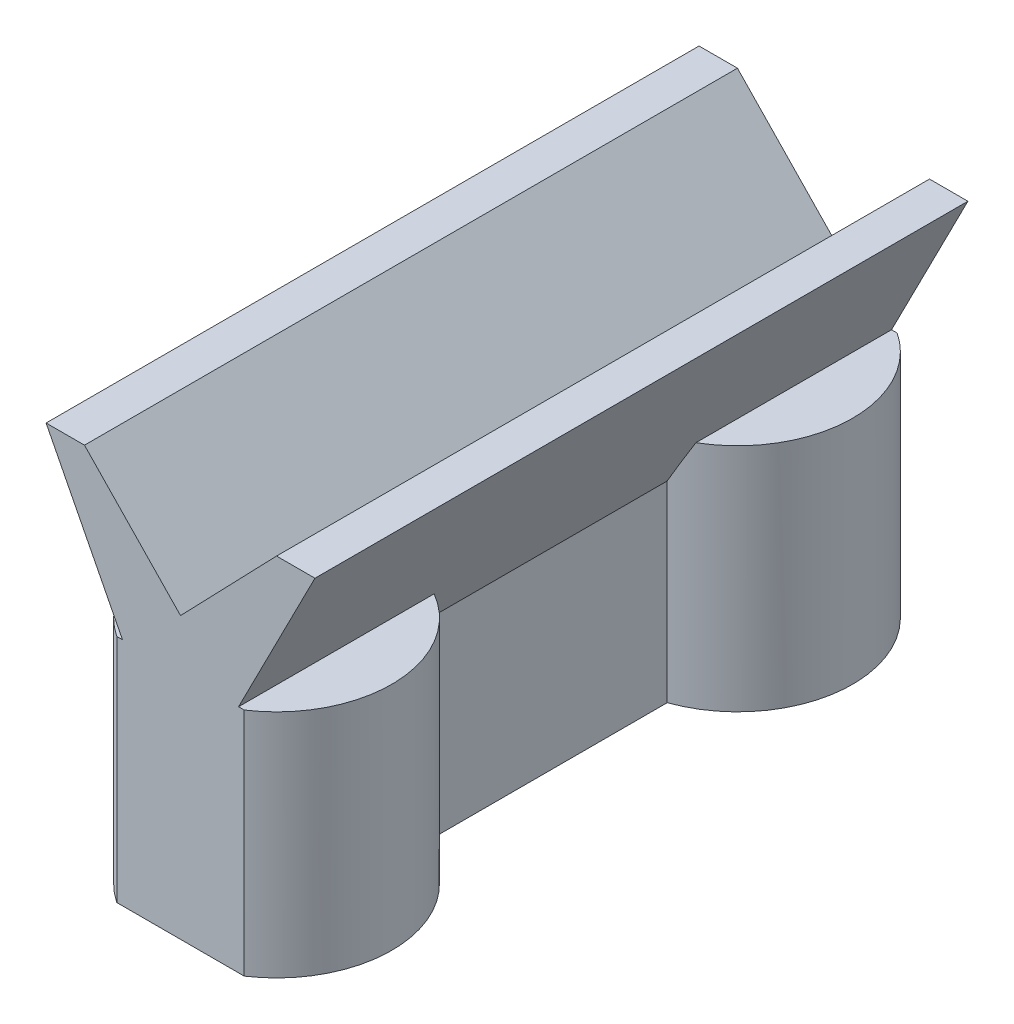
ISO-10303-21;
HEADER;
FILE_DESCRIPTION(('STEP AP214'),'2;1');
FILE_NAME('part.step','',(''),(''),'','','');
FILE_SCHEMA(('AUTOMOTIVE_DESIGN { 1 0 10303 214 1 1 1 1 }'));
ENDSEC;
DATA;
#1=APPLICATION_CONTEXT('core data for automotive mechanical design processes');
#2=APPLICATION_PROTOCOL_DEFINITION('international standard','automotive_design',2000,#1);
#3=PRODUCT_CONTEXT('',#1,'mechanical');
#4=PRODUCT('Part','Part','',(#3));
#5=PRODUCT_RELATED_PRODUCT_CATEGORY('part','',(#4));
#6=PRODUCT_DEFINITION_FORMATION('','',#4);
#7=PRODUCT_DEFINITION_CONTEXT('part definition',#1,'design');
#8=PRODUCT_DEFINITION('design','',#6,#7);
#9=PRODUCT_DEFINITION_SHAPE('','',#8);
#10=(LENGTH_UNIT() NAMED_UNIT(*) SI_UNIT(.MILLI.,.METRE.));
#11=(NAMED_UNIT(*) PLANE_ANGLE_UNIT() SI_UNIT($,.RADIAN.));
#12=(NAMED_UNIT(*) SI_UNIT($,.STERADIAN.) SOLID_ANGLE_UNIT());
#13=UNCERTAINTY_MEASURE_WITH_UNIT(LENGTH_MEASURE(1.E-05),#10,'distance_accuracy_value','');
#14=(GEOMETRIC_REPRESENTATION_CONTEXT(3) GLOBAL_UNCERTAINTY_ASSIGNED_CONTEXT((#13)) GLOBAL_UNIT_ASSIGNED_CONTEXT((#10,
#11,#12)) REPRESENTATION_CONTEXT('',''));
#15=CARTESIAN_POINT('',(0.,0.,0.));
#16=DIRECTION('',(0.,0.,1.));
#17=DIRECTION('',(1.,0.,0.));
#18=AXIS2_PLACEMENT_3D('',#15,#16,#17);
#19=CARTESIAN_POINT('',(0.,-2.14325933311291,14.5));
#20=DIRECTION('',(0.,-1.,0.));
#21=DIRECTION('',(0.,0.,-1.));
#22=AXIS2_PLACEMENT_3D('',#19,#20,#21);
#23=CYLINDRICAL_SURFACE('',#22,3.);
#24=DIRECTION('',(0.,-1.,0.));
#25=VECTOR('',#24,1.);
#26=CARTESIAN_POINT('',(1.6583123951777,-2.14325933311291,17.));
#27=LINE('',#26,#25);
#28=CARTESIAN_POINT('',(1.6583123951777,-8.1432593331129,17.));
#29=VERTEX_POINT('',#28);
#30=CARTESIAN_POINT('',(1.6583123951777,-2.14325933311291,17.));
#31=VERTEX_POINT('',#30);
#32=EDGE_CURVE('E48',#29,#31,#27,.F.);
#33=ORIENTED_EDGE('',*,*,#32,.F.);
#34=CARTESIAN_POINT('',(0.,-8.1432593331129,14.5));
#35=DIRECTION('',(0.,-1.,0.));
#36=DIRECTION('',(0.,0.,-1.));
#37=AXIS2_PLACEMENT_3D('',#34,#35,#36);
#38=CIRCLE('',#37,3.);
#39=CARTESIAN_POINT('',(1.,-8.1432593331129,11.6715728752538));
#40=VERTEX_POINT('',#39);
#41=EDGE_CURVE('E285',#40,#29,#38,.T.);
#42=ORIENTED_EDGE('',*,*,#41,.F.);
#43=DIRECTION('',(0.,-1.,0.));
#44=VECTOR('',#43,1.);
#45=CARTESIAN_POINT('',(0.999999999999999,-2.1432593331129,11.6715728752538));
#46=LINE('',#45,#44);
#47=CARTESIAN_POINT('',(1.,-3.1432593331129,11.6715728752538));
#48=VERTEX_POINT('',#47);
#49=EDGE_CURVE('E277',#40,#48,#46,.F.);
#50=ORIENTED_EDGE('',*,*,#49,.T.);
#51=CARTESIAN_POINT('',(0.,-5.10046831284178,14.5));
#52=DIRECTION('',(0.890499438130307,-0.454984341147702,0.));
#53=DIRECTION('',(-0.454984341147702,-0.890499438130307,0.));
#54=AXIS2_PLACEMENT_3D('',#51,#52,#53);
#55=ELLIPSE('',#54,6.59363351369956,3.);
#56=CARTESIAN_POINT('',(1.51093164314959,-2.14325933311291,11.9082659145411));
#57=VERTEX_POINT('',#56);
#58=EDGE_CURVE('E200',#48,#57,#55,.T.);
#59=ORIENTED_EDGE('',*,*,#58,.T.);
#60=CARTESIAN_POINT('',(0.,-2.14325933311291,14.5));
#61=DIRECTION('',(0.,-1.,0.));
#62=DIRECTION('',(0.,0.,-1.));
#63=AXIS2_PLACEMENT_3D('',#60,#61,#62);
#64=CIRCLE('',#63,3.);
#65=EDGE_CURVE('E284',#57,#31,#64,.T.);
#66=ORIENTED_EDGE('',*,*,#65,.T.);
#67=EDGE_LOOP('',(#33,#42,#50,#59,#66));
#68=FACE_BOUND('',#67,.T.);
#69=ADVANCED_FACE('F33',(#68),#23,.T.);
#70=CARTESIAN_POINT('',(0.,-2.14325933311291,14.5));
#71=DIRECTION('',(0.,-1.,0.));
#72=DIRECTION('',(0.,0.,-1.));
#73=AXIS2_PLACEMENT_3D('',#70,#71,#72);
#74=PLANE('',#73);
#75=CARTESIAN_POINT('',(-1.6583123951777,-2.14325933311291,17.));
#76=VERTEX_POINT('',#75);
#77=CARTESIAN_POINT('',(-1.51093164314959,-2.14325933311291,11.9082659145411));
#78=VERTEX_POINT('',#77);
#79=EDGE_CURVE('E288',#76,#78,#64,.T.);
#80=ORIENTED_EDGE('',*,*,#79,.F.);
#81=DIRECTION('',(1.,0.,0.));
#82=VECTOR('',#81,1.);
#83=CARTESIAN_POINT('',(0.,-2.14325933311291,17.));
#84=LINE('',#83,#82);
#85=CARTESIAN_POINT('',(-1.51093164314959,-2.14325933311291,17.));
#86=VERTEX_POINT('',#85);
#87=EDGE_CURVE('E11',#76,#86,#84,.T.);
#88=ORIENTED_EDGE('',*,*,#87,.T.);
#89=DIRECTION('',(0.,0.,-1.));
#90=VECTOR('',#89,1.);
#91=CARTESIAN_POINT('',(-1.51093164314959,-2.14325933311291,17.));
#92=LINE('',#91,#90);
#93=EDGE_CURVE('E281',#86,#78,#92,.T.);
#94=ORIENTED_EDGE('',*,*,#93,.T.);
#95=EDGE_LOOP('',(#80,#88,#94));
#96=FACE_BOUND('',#95,.T.);
#97=ADVANCED_FACE('F362',(#96),#74,.F.);
#98=CARTESIAN_POINT('',(0.,-2.14325933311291,2.5));
#99=DIRECTION('',(0.,-1.,0.));
#100=DIRECTION('',(0.,0.,-1.));
#101=AXIS2_PLACEMENT_3D('',#98,#99,#100);
#102=CYLINDRICAL_SURFACE('',#101,3.);
#103=DIRECTION('',(0.,-1.,0.));
#104=VECTOR('',#103,1.);
#105=CARTESIAN_POINT('',(-1.6583123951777,-2.14325933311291,0.));
#106=LINE('',#105,#104);
#107=CARTESIAN_POINT('',(-1.6583123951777,-8.1432593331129,0.));
#108=VERTEX_POINT('',#107);
#109=CARTESIAN_POINT('',(-1.6583123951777,-2.14325933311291,0.));
#110=VERTEX_POINT('',#109);
#111=EDGE_CURVE('E56',#108,#110,#106,.F.);
#112=ORIENTED_EDGE('',*,*,#111,.F.);
#113=CARTESIAN_POINT('',(0.,-8.1432593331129,2.5));
#114=DIRECTION('',(0.,-1.,0.));
#115=DIRECTION('',(0.,0.,-1.));
#116=AXIS2_PLACEMENT_3D('',#113,#114,#115);
#117=CIRCLE('',#116,3.);
#118=CARTESIAN_POINT('',(-0.999999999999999,-8.1432593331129,5.32842712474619));
#119=VERTEX_POINT('',#118);
#120=EDGE_CURVE('E296',#119,#108,#117,.T.);
#121=ORIENTED_EDGE('',*,*,#120,.F.);
#122=DIRECTION('',(0.,-1.,0.));
#123=VECTOR('',#122,1.);
#124=CARTESIAN_POINT('',(-0.999999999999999,-2.14325933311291,5.32842712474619));
#125=LINE('',#124,#123);
#126=CARTESIAN_POINT('',(-0.999999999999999,-3.14325933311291,5.32842712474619));
#127=VERTEX_POINT('',#126);
#128=EDGE_CURVE('E226',#127,#119,#125,.T.);
#129=ORIENTED_EDGE('',*,*,#128,.F.);
#130=CARTESIAN_POINT('',(0.,-5.10046831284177,2.5));
#131=DIRECTION('',(0.890499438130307,0.454984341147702,0.));
#132=DIRECTION('',(0.454984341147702,-0.890499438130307,0.));
#133=AXIS2_PLACEMENT_3D('',#130,#131,#132);
#134=ELLIPSE('',#133,6.59363351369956,3.);
#135=CARTESIAN_POINT('',(-1.51093164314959,-2.14325933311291,5.09173408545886));
#136=VERTEX_POINT('',#135);
#137=EDGE_CURVE('E292',#136,#127,#134,.T.);
#138=ORIENTED_EDGE('',*,*,#137,.F.);
#139=CARTESIAN_POINT('',(0.,-2.14325933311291,2.5));
#140=DIRECTION('',(0.,-1.,0.));
#141=DIRECTION('',(0.,0.,-1.));
#142=AXIS2_PLACEMENT_3D('',#139,#140,#141);
#143=CIRCLE('',#142,3.);
#144=EDGE_CURVE('E164',#136,#110,#143,.T.);
#145=ORIENTED_EDGE('',*,*,#144,.T.);
#146=EDGE_LOOP('',(#112,#121,#129,#138,#145));
#147=FACE_BOUND('',#146,.T.);
#148=ADVANCED_FACE('F367',(#147),#102,.T.);
#149=CARTESIAN_POINT('',(0.,-2.14325933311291,2.5));
#150=DIRECTION('',(0.,-1.,0.));
#151=DIRECTION('',(0.,0.,-1.));
#152=AXIS2_PLACEMENT_3D('',#149,#150,#151);
#153=PLANE('',#152);
#154=CARTESIAN_POINT('',(1.6583123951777,-2.14325933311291,0.));
#155=VERTEX_POINT('',#154);
#156=CARTESIAN_POINT('',(1.51093164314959,-2.14325933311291,5.09173408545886));
#157=VERTEX_POINT('',#156);
#158=EDGE_CURVE('E215',#155,#157,#143,.T.);
#159=ORIENTED_EDGE('',*,*,#158,.F.);
#160=DIRECTION('',(-1.,0.,0.));
#161=VECTOR('',#160,1.);
#162=CARTESIAN_POINT('',(0.,-2.14325933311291,0.));
#163=LINE('',#162,#161);
#164=CARTESIAN_POINT('',(1.51093164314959,-2.14325933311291,0.));
#165=VERTEX_POINT('',#164);
#166=EDGE_CURVE('E159',#155,#165,#163,.T.);
#167=ORIENTED_EDGE('',*,*,#166,.T.);
#168=DIRECTION('',(0.,0.,-1.));
#169=VECTOR('',#168,1.);
#170=CARTESIAN_POINT('',(1.51093164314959,-2.14325933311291,17.));
#171=LINE('',#170,#169);
#172=EDGE_CURVE('E203',#157,#165,#171,.T.);
#173=ORIENTED_EDGE('',*,*,#172,.F.);
#174=EDGE_LOOP('',(#159,#167,#173));
#175=FACE_BOUND('',#174,.T.);
#176=ADVANCED_FACE('F349',(#175),#153,.F.);
#177=CARTESIAN_POINT('',(0.,0.,0.));
#178=DIRECTION('',(0.,0.,-1.));
#179=DIRECTION('',(-1.,0.,0.));
#180=AXIS2_PLACEMENT_3D('',#177,#178,#179);
#181=PLANE('',#180);
#182=DIRECTION('',(-0.454984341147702,-0.890499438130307,0.));
#183=VECTOR('',#182,1.);
#184=CARTESIAN_POINT('',(1.,-3.1432593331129,0.));
#185=LINE('',#184,#183);
#186=CARTESIAN_POINT('',(3.5,1.74976311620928,0.));
#187=VERTEX_POINT('',#186);
#188=EDGE_CURVE('E263',#187,#165,#185,.T.);
#189=ORIENTED_EDGE('',*,*,#188,.T.);
#190=ORIENTED_EDGE('',*,*,#166,.F.);
#191=DIRECTION('',(0.,-1.,0.));
#192=VECTOR('',#191,1.);
#193=CARTESIAN_POINT('',(1.6583123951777,-2.14325933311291,0.));
#194=LINE('',#193,#192);
#195=CARTESIAN_POINT('',(1.6583123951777,-8.1432593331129,0.));
#196=VERTEX_POINT('',#195);
#197=EDGE_CURVE('E305',#155,#196,#194,.T.);
#198=ORIENTED_EDGE('',*,*,#197,.T.);
#199=DIRECTION('',(1.,0.,0.));
#200=VECTOR('',#199,1.);
#201=CARTESIAN_POINT('',(-3.5,-8.1432593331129,0.));
#202=LINE('',#201,#200);
#203=EDGE_CURVE('E308',#108,#196,#202,.T.);
#204=ORIENTED_EDGE('',*,*,#203,.F.);
#205=ORIENTED_EDGE('',*,*,#111,.T.);
#206=CARTESIAN_POINT('',(-1.51093164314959,-2.14325933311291,0.));
#207=VERTEX_POINT('',#206);
#208=EDGE_CURVE('E149',#207,#110,#163,.T.);
#209=ORIENTED_EDGE('',*,*,#208,.F.);
#210=DIRECTION('',(0.454984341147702,-0.890499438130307,0.));
#211=VECTOR('',#210,1.);
#212=CARTESIAN_POINT('',(-0.999999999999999,-3.14325933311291,0.));
#213=LINE('',#212,#211);
#214=CARTESIAN_POINT('',(-3.5,1.74976311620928,0.));
#215=VERTEX_POINT('',#214);
#216=EDGE_CURVE('E155',#215,#207,#213,.T.);
#217=ORIENTED_EDGE('',*,*,#216,.F.);
#218=DIRECTION('',(-1.,0.,0.));
#219=VECTOR('',#218,1.);
#220=CARTESIAN_POINT('',(-3.5,1.74976311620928,0.));
#221=LINE('',#220,#219);
#222=CARTESIAN_POINT('',(-2.5,1.74976311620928,0.));
#223=VERTEX_POINT('',#222);
#224=EDGE_CURVE('E175',#223,#215,#221,.T.);
#225=ORIENTED_EDGE('',*,*,#224,.F.);
#226=DIRECTION('',(-0.694075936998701,0.719901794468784,0.));
#227=VECTOR('',#226,1.);
#228=CARTESIAN_POINT('',(-2.5,1.74976311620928,0.));
#229=LINE('',#228,#227);
#230=CARTESIAN_POINT('',(0.,-0.843259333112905,0.));
#231=VERTEX_POINT('',#230);
#232=EDGE_CURVE('E179',#231,#223,#229,.T.);
#233=ORIENTED_EDGE('',*,*,#232,.F.);
#234=DIRECTION('',(0.694075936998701,0.719901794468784,0.));
#235=VECTOR('',#234,1.);
#236=CARTESIAN_POINT('',(2.5,1.74976311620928,0.));
#237=LINE('',#236,#235);
#238=CARTESIAN_POINT('',(2.5,1.74976311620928,0.));
#239=VERTEX_POINT('',#238);
#240=EDGE_CURVE('E254',#231,#239,#237,.T.);
#241=ORIENTED_EDGE('',*,*,#240,.T.);
#242=DIRECTION('',(1.,0.,0.));
#243=VECTOR('',#242,1.);
#244=CARTESIAN_POINT('',(3.5,1.74976311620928,0.));
#245=LINE('',#244,#243);
#246=EDGE_CURVE('E258',#239,#187,#245,.T.);
#247=ORIENTED_EDGE('',*,*,#246,.T.);
#248=EDGE_LOOP('',(#189,#190,#198,#204,#205,#209,#217,#225,#233,#241,#247));
#249=FACE_BOUND('',#248,.T.);
#250=ADVANCED_FACE('F152',(#249),#181,.T.);
#251=CARTESIAN_POINT('',(0.,0.,17.));
#252=DIRECTION('',(0.,0.,-1.));
#253=DIRECTION('',(-1.,0.,0.));
#254=AXIS2_PLACEMENT_3D('',#251,#252,#253);
#255=PLANE('',#254);
#256=DIRECTION('',(0.454984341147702,-0.890499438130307,0.));
#257=VECTOR('',#256,1.);
#258=CARTESIAN_POINT('',(-0.999999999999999,-3.14325933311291,17.));
#259=LINE('',#258,#257);
#260=CARTESIAN_POINT('',(-3.5,1.74976311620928,17.));
#261=VERTEX_POINT('',#260);
#262=EDGE_CURVE('E187',#261,#86,#259,.T.);
#263=ORIENTED_EDGE('',*,*,#262,.T.);
#264=ORIENTED_EDGE('',*,*,#87,.F.);
#265=DIRECTION('',(0.,-1.,0.));
#266=VECTOR('',#265,1.);
#267=CARTESIAN_POINT('',(-1.6583123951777,-2.14325933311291,17.));
#268=LINE('',#267,#266);
#269=CARTESIAN_POINT('',(-1.6583123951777,-8.1432593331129,17.));
#270=VERTEX_POINT('',#269);
#271=EDGE_CURVE('E302',#76,#270,#268,.T.);
#272=ORIENTED_EDGE('',*,*,#271,.T.);
#273=DIRECTION('',(-1.,0.,0.));
#274=VECTOR('',#273,1.);
#275=CARTESIAN_POINT('',(-3.5,-8.1432593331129,17.));
#276=LINE('',#275,#274);
#277=EDGE_CURVE('E307',#29,#270,#276,.T.);
#278=ORIENTED_EDGE('',*,*,#277,.F.);
#279=ORIENTED_EDGE('',*,*,#32,.T.);
#280=CARTESIAN_POINT('',(1.51093164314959,-2.14325933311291,17.));
#281=VERTEX_POINT('',#280);
#282=EDGE_CURVE('E37',#281,#31,#84,.T.);
#283=ORIENTED_EDGE('',*,*,#282,.F.);
#284=DIRECTION('',(-0.454984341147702,-0.890499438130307,0.));
#285=VECTOR('',#284,1.);
#286=CARTESIAN_POINT('',(1.,-3.1432593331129,17.));
#287=LINE('',#286,#285);
#288=CARTESIAN_POINT('',(3.5,1.74976311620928,17.));
#289=VERTEX_POINT('',#288);
#290=EDGE_CURVE('E257',#289,#281,#287,.T.);
#291=ORIENTED_EDGE('',*,*,#290,.F.);
#292=DIRECTION('',(1.,0.,0.));
#293=VECTOR('',#292,1.);
#294=CARTESIAN_POINT('',(3.5,1.74976311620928,17.));
#295=LINE('',#294,#293);
#296=CARTESIAN_POINT('',(2.5,1.74976311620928,17.));
#297=VERTEX_POINT('',#296);
#298=EDGE_CURVE('E261',#297,#289,#295,.T.);
#299=ORIENTED_EDGE('',*,*,#298,.F.);
#300=DIRECTION('',(0.694075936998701,0.719901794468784,0.));
#301=VECTOR('',#300,1.);
#302=CARTESIAN_POINT('',(2.5,1.74976311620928,17.));
#303=LINE('',#302,#301);
#304=CARTESIAN_POINT('',(0.,-0.843259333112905,17.));
#305=VERTEX_POINT('',#304);
#306=EDGE_CURVE('E251',#305,#297,#303,.T.);
#307=ORIENTED_EDGE('',*,*,#306,.F.);
#308=DIRECTION('',(-0.694075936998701,0.719901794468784,0.));
#309=VECTOR('',#308,1.);
#310=CARTESIAN_POINT('',(-2.5,1.74976311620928,17.));
#311=LINE('',#310,#309);
#312=CARTESIAN_POINT('',(-2.5,1.74976311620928,17.));
#313=VERTEX_POINT('',#312);
#314=EDGE_CURVE('E174',#305,#313,#311,.T.);
#315=ORIENTED_EDGE('',*,*,#314,.T.);
#316=DIRECTION('',(-1.,0.,0.));
#317=VECTOR('',#316,1.);
#318=CARTESIAN_POINT('',(-3.5,1.74976311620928,17.));
#319=LINE('',#318,#317);
#320=EDGE_CURVE('E177',#313,#261,#319,.T.);
#321=ORIENTED_EDGE('',*,*,#320,.T.);
#322=EDGE_LOOP('',(#263,#264,#272,#278,#279,#283,#291,#299,#307,#315,#321));
#323=FACE_BOUND('',#322,.T.);
#324=ADVANCED_FACE('F247',(#323),#255,.F.);
#325=CARTESIAN_POINT('',(-2.5,1.74976311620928,17.));
#326=DIRECTION('',(-0.719901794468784,-0.694075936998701,0.));
#327=DIRECTION('',(0.694075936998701,-0.719901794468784,0.));
#328=AXIS2_PLACEMENT_3D('',#325,#326,#327);
#329=PLANE('',#328);
#330=ORIENTED_EDGE('',*,*,#232,.T.);
#331=DIRECTION('',(0.,0.,-1.));
#332=VECTOR('',#331,1.);
#333=CARTESIAN_POINT('',(-2.5,1.74976311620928,17.));
#334=LINE('',#333,#332);
#335=EDGE_CURVE('E191',#313,#223,#334,.T.);
#336=ORIENTED_EDGE('',*,*,#335,.F.);
#337=ORIENTED_EDGE('',*,*,#314,.F.);
#338=DIRECTION('',(0.,0.,-1.));
#339=VECTOR('',#338,1.);
#340=CARTESIAN_POINT('',(0.,-0.843259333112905,17.));
#341=LINE('',#340,#339);
#342=EDGE_CURVE('E194',#305,#231,#341,.T.);
#343=ORIENTED_EDGE('',*,*,#342,.T.);
#344=EDGE_LOOP('',(#330,#336,#337,#343));
#345=FACE_BOUND('',#344,.T.);
#346=ADVANCED_FACE('F35',(#345),#329,.F.);
#347=CARTESIAN_POINT('',(-3.5,1.74976311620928,17.));
#348=DIRECTION('',(0.,-1.,0.));
#349=DIRECTION('',(0.,0.,-1.));
#350=AXIS2_PLACEMENT_3D('',#347,#348,#349);
#351=PLANE('',#350);
#352=ORIENTED_EDGE('',*,*,#224,.T.);
#353=DIRECTION('',(0.,0.,-1.));
#354=VECTOR('',#353,1.);
#355=CARTESIAN_POINT('',(-3.5,1.74976311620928,17.));
#356=LINE('',#355,#354);
#357=EDGE_CURVE('E173',#261,#215,#356,.T.);
#358=ORIENTED_EDGE('',*,*,#357,.F.);
#359=ORIENTED_EDGE('',*,*,#320,.F.);
#360=ORIENTED_EDGE('',*,*,#335,.T.);
#361=EDGE_LOOP('',(#352,#358,#359,#360));
#362=FACE_BOUND('',#361,.T.);
#363=ADVANCED_FACE('F246',(#362),#351,.F.);
#364=CARTESIAN_POINT('',(-0.999999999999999,-3.14325933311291,17.));
#365=DIRECTION('',(0.890499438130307,0.454984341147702,0.));
#366=DIRECTION('',(-0.454984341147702,0.890499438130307,0.));
#367=AXIS2_PLACEMENT_3D('',#364,#365,#366);
#368=PLANE('',#367);
#369=DIRECTION('',(0.,0.,-1.));
#370=VECTOR('',#369,1.);
#371=CARTESIAN_POINT('',(-1.51093164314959,-2.14325933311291,17.));
#372=LINE('',#371,#370);
#373=EDGE_CURVE('E162',#136,#207,#372,.T.);
#374=ORIENTED_EDGE('',*,*,#373,.F.);
#375=ORIENTED_EDGE('',*,*,#137,.T.);
#376=DIRECTION('',(0.,0.,-1.));
#377=VECTOR('',#376,1.);
#378=CARTESIAN_POINT('',(-0.999999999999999,-3.14325933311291,17.));
#379=LINE('',#378,#377);
#380=CARTESIAN_POINT('',(-0.999999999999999,-3.14325933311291,11.6715728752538));
#381=VERTEX_POINT('',#380);
#382=EDGE_CURVE('E186',#381,#127,#379,.T.);
#383=ORIENTED_EDGE('',*,*,#382,.F.);
#384=CARTESIAN_POINT('',(0.,-5.10046831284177,14.5));
#385=DIRECTION('',(0.890499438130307,0.454984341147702,0.));
#386=DIRECTION('',(0.454984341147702,-0.890499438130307,0.));
#387=AXIS2_PLACEMENT_3D('',#384,#385,#386);
#388=ELLIPSE('',#387,6.59363351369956,3.);
#389=EDGE_CURVE('E269',#381,#78,#388,.T.);
#390=ORIENTED_EDGE('',*,*,#389,.T.);
#391=ORIENTED_EDGE('',*,*,#93,.F.);
#392=ORIENTED_EDGE('',*,*,#262,.F.);
#393=ORIENTED_EDGE('',*,*,#357,.T.);
#394=ORIENTED_EDGE('',*,*,#216,.T.);
#395=EDGE_LOOP('',(#374,#375,#383,#390,#391,#392,#393,#394));
#396=FACE_BOUND('',#395,.T.);
#397=ADVANCED_FACE('F170',(#396),#368,.F.);
#398=CARTESIAN_POINT('',(-0.999999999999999,-8.1432593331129,17.));
#399=DIRECTION('',(1.,0.,0.));
#400=DIRECTION('',(0.,1.,0.));
#401=AXIS2_PLACEMENT_3D('',#398,#399,#400);
#402=PLANE('',#401);
#403=ORIENTED_EDGE('',*,*,#382,.T.);
#404=ORIENTED_EDGE('',*,*,#128,.T.);
#405=DIRECTION('',(0.,0.,-1.));
#406=VECTOR('',#405,1.);
#407=CARTESIAN_POINT('',(-0.999999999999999,-8.1432593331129,17.));
#408=LINE('',#407,#406);
#409=CARTESIAN_POINT('',(-0.999999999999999,-8.1432593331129,11.6715728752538));
#410=VERTEX_POINT('',#409);
#411=EDGE_CURVE('E183',#410,#119,#408,.T.);
#412=ORIENTED_EDGE('',*,*,#411,.F.);
#413=DIRECTION('',(0.,-1.,0.));
#414=VECTOR('',#413,1.);
#415=CARTESIAN_POINT('',(-0.999999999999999,-2.14325933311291,11.6715728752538));
#416=LINE('',#415,#414);
#417=EDGE_CURVE('E272',#410,#381,#416,.F.);
#418=ORIENTED_EDGE('',*,*,#417,.T.);
#419=EDGE_LOOP('',(#403,#404,#412,#418));
#420=FACE_BOUND('',#419,.T.);
#421=ADVANCED_FACE('F338',(#420),#402,.F.);
#422=CARTESIAN_POINT('',(0.,-8.1432593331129,17.));
#423=DIRECTION('',(0.,1.,0.));
#424=DIRECTION('',(0.,0.,1.));
#425=AXIS2_PLACEMENT_3D('',#422,#423,#424);
#426=PLANE('',#425);
#427=CARTESIAN_POINT('',(0.,-8.1432593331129,14.5));
#428=DIRECTION('',(0.,-1.,0.));
#429=DIRECTION('',(0.,0.,-1.));
#430=AXIS2_PLACEMENT_3D('',#427,#428,#429);
#431=CIRCLE('',#430,1.3);
#432=CARTESIAN_POINT('',(0.,-8.1432593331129,13.2));
#433=VERTEX_POINT('',#432);
#434=EDGE_CURVE('E320',#433,#433,#431,.T.);
#435=ORIENTED_EDGE('',*,*,#434,.F.);
#436=EDGE_LOOP('',(#435));
#437=FACE_BOUND('',#436,.T.);
#438=CARTESIAN_POINT('',(0.,-8.1432593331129,2.5));
#439=DIRECTION('',(0.,-1.,0.));
#440=DIRECTION('',(0.,0.,-1.));
#441=AXIS2_PLACEMENT_3D('',#438,#439,#440);
#442=CIRCLE('',#441,1.3);
#443=CARTESIAN_POINT('',(0.,-8.1432593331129,1.2));
#444=VERTEX_POINT('',#443);
#445=EDGE_CURVE('E314',#444,#444,#442,.T.);
#446=ORIENTED_EDGE('',*,*,#445,.F.);
#447=EDGE_LOOP('',(#446));
#448=FACE_BOUND('',#447,.T.);
#449=ORIENTED_EDGE('',*,*,#41,.T.);
#450=ORIENTED_EDGE('',*,*,#277,.T.);
#451=EDGE_CURVE('E289',#270,#410,#38,.T.);
#452=ORIENTED_EDGE('',*,*,#451,.T.);
#453=ORIENTED_EDGE('',*,*,#411,.T.);
#454=ORIENTED_EDGE('',*,*,#120,.T.);
#455=ORIENTED_EDGE('',*,*,#203,.T.);
#456=CARTESIAN_POINT('',(1.,-8.1432593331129,5.32842712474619));
#457=VERTEX_POINT('',#456);
#458=EDGE_CURVE('E299',#196,#457,#117,.T.);
#459=ORIENTED_EDGE('',*,*,#458,.T.);
#460=DIRECTION('',(0.,0.,-1.));
#461=VECTOR('',#460,1.);
#462=CARTESIAN_POINT('',(1.,-8.1432593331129,17.));
#463=LINE('',#462,#461);
#464=EDGE_CURVE('E225',#40,#457,#463,.T.);
#465=ORIENTED_EDGE('',*,*,#464,.F.);
#466=EDGE_LOOP('',(#449,#450,#452,#453,#454,#455,#459,#465));
#467=FACE_BOUND('',#466,.T.);
#468=ADVANCED_FACE('F335',(#437,#448,#467),#426,.F.);
#469=CARTESIAN_POINT('',(1.,-8.1432593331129,17.));
#470=DIRECTION('',(1.,0.,0.));
#471=DIRECTION('',(0.,1.,0.));
#472=AXIS2_PLACEMENT_3D('',#469,#470,#471);
#473=PLANE('',#472);
#474=DIRECTION('',(0.,-1.,0.));
#475=VECTOR('',#474,1.);
#476=CARTESIAN_POINT('',(0.999999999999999,-2.1432593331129,5.32842712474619));
#477=LINE('',#476,#475);
#478=CARTESIAN_POINT('',(1.,-3.1432593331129,5.32842712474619));
#479=VERTEX_POINT('',#478);
#480=EDGE_CURVE('E167',#479,#457,#477,.T.);
#481=ORIENTED_EDGE('',*,*,#480,.F.);
#482=DIRECTION('',(0.,0.,-1.));
#483=VECTOR('',#482,1.);
#484=CARTESIAN_POINT('',(1.,-3.1432593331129,17.));
#485=LINE('',#484,#483);
#486=EDGE_CURVE('E223',#48,#479,#485,.T.);
#487=ORIENTED_EDGE('',*,*,#486,.F.);
#488=ORIENTED_EDGE('',*,*,#49,.F.);
#489=ORIENTED_EDGE('',*,*,#464,.T.);
#490=EDGE_LOOP('',(#481,#487,#488,#489));
#491=FACE_BOUND('',#490,.T.);
#492=ADVANCED_FACE('F221',(#491),#473,.T.);
#493=CARTESIAN_POINT('',(1.,-3.1432593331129,17.));
#494=DIRECTION('',(0.890499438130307,-0.454984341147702,0.));
#495=DIRECTION('',(0.454984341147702,0.890499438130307,0.));
#496=AXIS2_PLACEMENT_3D('',#493,#494,#495);
#497=PLANE('',#496);
#498=CARTESIAN_POINT('',(0.,-5.10046831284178,2.5));
#499=DIRECTION('',(0.890499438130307,-0.454984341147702,0.));
#500=DIRECTION('',(-0.454984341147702,-0.890499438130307,0.));
#501=AXIS2_PLACEMENT_3D('',#498,#499,#500);
#502=ELLIPSE('',#501,6.59363351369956,3.);
#503=EDGE_CURVE('E160',#157,#479,#502,.T.);
#504=ORIENTED_EDGE('',*,*,#503,.F.);
#505=ORIENTED_EDGE('',*,*,#172,.T.);
#506=ORIENTED_EDGE('',*,*,#188,.F.);
#507=DIRECTION('',(0.,0.,-1.));
#508=VECTOR('',#507,1.);
#509=CARTESIAN_POINT('',(3.5,1.74976311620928,17.));
#510=LINE('',#509,#508);
#511=EDGE_CURVE('E230',#289,#187,#510,.T.);
#512=ORIENTED_EDGE('',*,*,#511,.F.);
#513=ORIENTED_EDGE('',*,*,#290,.T.);
#514=DIRECTION('',(0.,0.,-1.));
#515=VECTOR('',#514,1.);
#516=CARTESIAN_POINT('',(1.51093164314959,-2.14325933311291,17.));
#517=LINE('',#516,#515);
#518=EDGE_CURVE('E197',#281,#57,#517,.T.);
#519=ORIENTED_EDGE('',*,*,#518,.T.);
#520=ORIENTED_EDGE('',*,*,#58,.F.);
#521=ORIENTED_EDGE('',*,*,#486,.T.);
#522=EDGE_LOOP('',(#504,#505,#506,#512,#513,#519,#520,#521));
#523=FACE_BOUND('',#522,.T.);
#524=ADVANCED_FACE('F229',(#523),#497,.T.);
#525=CARTESIAN_POINT('',(3.5,1.74976311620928,17.));
#526=DIRECTION('',(0.,1.,0.));
#527=DIRECTION('',(-1.,0.,0.));
#528=AXIS2_PLACEMENT_3D('',#525,#526,#527);
#529=PLANE('',#528);
#530=ORIENTED_EDGE('',*,*,#246,.F.);
#531=DIRECTION('',(0.,0.,-1.));
#532=VECTOR('',#531,1.);
#533=CARTESIAN_POINT('',(2.5,1.74976311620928,17.));
#534=LINE('',#533,#532);
#535=EDGE_CURVE('E233',#297,#239,#534,.T.);
#536=ORIENTED_EDGE('',*,*,#535,.F.);
#537=ORIENTED_EDGE('',*,*,#298,.T.);
#538=ORIENTED_EDGE('',*,*,#511,.T.);
#539=EDGE_LOOP('',(#530,#536,#537,#538));
#540=FACE_BOUND('',#539,.T.);
#541=ADVANCED_FACE('F351',(#540),#529,.T.);
#542=CARTESIAN_POINT('',(2.5,1.74976311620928,17.));
#543=DIRECTION('',(-0.719901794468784,0.694075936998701,0.));
#544=DIRECTION('',(-0.694075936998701,-0.719901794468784,0.));
#545=AXIS2_PLACEMENT_3D('',#542,#543,#544);
#546=PLANE('',#545);
#547=ORIENTED_EDGE('',*,*,#240,.F.);
#548=ORIENTED_EDGE('',*,*,#342,.F.);
#549=ORIENTED_EDGE('',*,*,#306,.T.);
#550=ORIENTED_EDGE('',*,*,#535,.T.);
#551=EDGE_LOOP('',(#547,#548,#549,#550));
#552=FACE_BOUND('',#551,.T.);
#553=ADVANCED_FACE('F253',(#552),#546,.T.);
#554=ORIENTED_EDGE('',*,*,#271,.F.);
#555=ORIENTED_EDGE('',*,*,#79,.T.);
#556=ORIENTED_EDGE('',*,*,#389,.F.);
#557=ORIENTED_EDGE('',*,*,#417,.F.);
#558=ORIENTED_EDGE('',*,*,#451,.F.);
#559=EDGE_LOOP('',(#554,#555,#556,#557,#558));
#560=FACE_BOUND('',#559,.T.);
#561=ADVANCED_FACE('F358',(#560),#23,.T.);
#562=ORIENTED_EDGE('',*,*,#518,.F.);
#563=ORIENTED_EDGE('',*,*,#282,.T.);
#564=ORIENTED_EDGE('',*,*,#65,.F.);
#565=EDGE_LOOP('',(#562,#563,#564));
#566=FACE_BOUND('',#565,.T.);
#567=ADVANCED_FACE('F346',(#566),#74,.F.);
#568=ORIENTED_EDGE('',*,*,#197,.F.);
#569=ORIENTED_EDGE('',*,*,#158,.T.);
#570=ORIENTED_EDGE('',*,*,#503,.T.);
#571=ORIENTED_EDGE('',*,*,#480,.T.);
#572=ORIENTED_EDGE('',*,*,#458,.F.);
#573=EDGE_LOOP('',(#568,#569,#570,#571,#572));
#574=FACE_BOUND('',#573,.T.);
#575=ADVANCED_FACE('F211',(#574),#102,.T.);
#576=ORIENTED_EDGE('',*,*,#373,.T.);
#577=ORIENTED_EDGE('',*,*,#208,.T.);
#578=ORIENTED_EDGE('',*,*,#144,.F.);
#579=EDGE_LOOP('',(#576,#577,#578));
#580=FACE_BOUND('',#579,.T.);
#581=ADVANCED_FACE('F163',(#580),#153,.F.);
#582=CARTESIAN_POINT('',(0.,-2.14325933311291,2.5));
#583=DIRECTION('',(0.,-1.,0.));
#584=DIRECTION('',(0.,0.,-1.));
#585=AXIS2_PLACEMENT_3D('',#582,#583,#584);
#586=CYLINDRICAL_SURFACE('',#585,1.3);
#587=CARTESIAN_POINT('',(0.,-2.14325933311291,2.5));
#588=DIRECTION('',(0.,-1.,0.));
#589=DIRECTION('',(0.,0.,-1.));
#590=AXIS2_PLACEMENT_3D('',#587,#588,#589);
#591=CIRCLE('',#590,1.3);
#592=CARTESIAN_POINT('',(0.,-2.14325933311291,1.2));
#593=VERTEX_POINT('',#592);
#594=EDGE_CURVE('E317',#593,#593,#591,.T.);
#595=ORIENTED_EDGE('',*,*,#594,.F.);
#596=EDGE_LOOP('',(#595));
#597=FACE_BOUND('',#596,.T.);
#598=ORIENTED_EDGE('',*,*,#445,.T.);
#599=EDGE_LOOP('',(#598));
#600=FACE_BOUND('',#599,.T.);
#601=ADVANCED_FACE('F391',(#597,#600),#586,.F.);
#602=CARTESIAN_POINT('',(0.,-2.14325933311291,2.5));
#603=DIRECTION('',(0.,-1.,0.));
#604=DIRECTION('',(0.,0.,-1.));
#605=AXIS2_PLACEMENT_3D('',#602,#603,#604);
#606=PLANE('',#605);
#607=ORIENTED_EDGE('',*,*,#594,.T.);
#608=EDGE_LOOP('',(#607));
#609=FACE_BOUND('',#608,.T.);
#610=ADVANCED_FACE('F331',(#609),#606,.T.);
#611=CARTESIAN_POINT('',(0.,-2.14325933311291,14.5));
#612=DIRECTION('',(0.,-1.,0.));
#613=DIRECTION('',(0.,0.,-1.));
#614=AXIS2_PLACEMENT_3D('',#611,#612,#613);
#615=CYLINDRICAL_SURFACE('',#614,1.3);
#616=CARTESIAN_POINT('',(0.,-2.14325933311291,14.5));
#617=DIRECTION('',(0.,-1.,0.));
#618=DIRECTION('',(0.,0.,-1.));
#619=AXIS2_PLACEMENT_3D('',#616,#617,#618);
#620=CIRCLE('',#619,1.3);
#621=CARTESIAN_POINT('',(0.,-2.14325933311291,13.2));
#622=VERTEX_POINT('',#621);
#623=EDGE_CURVE('E311',#622,#622,#620,.T.);
#624=ORIENTED_EDGE('',*,*,#623,.F.);
#625=EDGE_LOOP('',(#624));
#626=FACE_BOUND('',#625,.T.);
#627=ORIENTED_EDGE('',*,*,#434,.T.);
#628=EDGE_LOOP('',(#627));
#629=FACE_BOUND('',#628,.T.);
#630=ADVANCED_FACE('F328',(#626,#629),#615,.F.);
#631=CARTESIAN_POINT('',(0.,-2.14325933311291,14.5));
#632=DIRECTION('',(0.,-1.,0.));
#633=DIRECTION('',(0.,0.,-1.));
#634=AXIS2_PLACEMENT_3D('',#631,#632,#633);
#635=PLANE('',#634);
#636=ORIENTED_EDGE('',*,*,#623,.T.);
#637=EDGE_LOOP('',(#636));
#638=FACE_BOUND('',#637,.T.);
#639=ADVANCED_FACE('F326',(#638),#635,.T.);
#640=CLOSED_SHELL('',(#69,#97,#148,#176,#250,#324,#346,#363,#397,#421,#468,#492,#524,#541,#553,
#561,#567,#575,#581,#601,#610,#630,#639));
#641=MANIFOLD_SOLID_BREP('B2',#640);
#642=ADVANCED_BREP_SHAPE_REPRESENTATION('',(#18,#641),#14);
#643=SHAPE_DEFINITION_REPRESENTATION(#9,#642);
ENDSEC;
END-ISO-10303-21;
